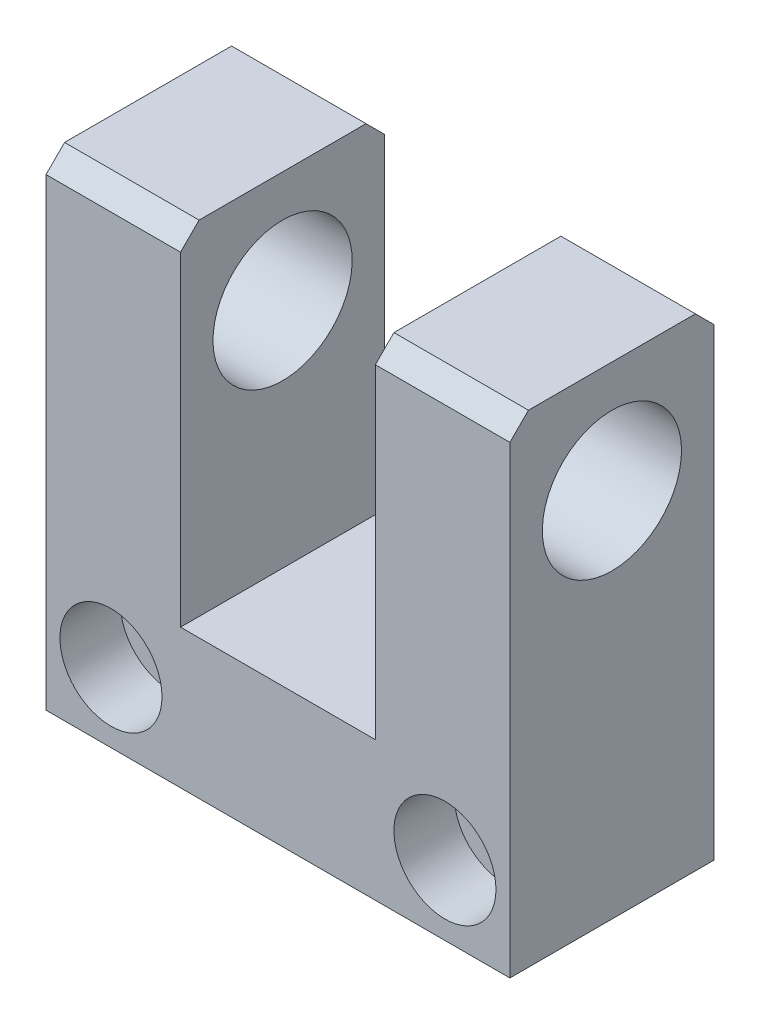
from build123d import *

# Parameters (mm, degrees)
BOSS_EXTRUDE1_DEPTH      = 25
BOSS_EXTRUDE1_DEPTH_BACK = 25
SKETCH1_R                = 7.5
CUT_EXTRUDE1_DEPTH       = 12
CUT_EXTRUDE1_DEPTH_BACK  = 12
SKETCH2_W                = 21
SKETCH2_H                = 37


with BuildPart() as part:
    # Sketch1 → Boss-Extrude1 (new, two sides: drawn at the far end of the back side and taken through both)
    with BuildSketch(Plane(origin=(0, 0, 0), x_dir=(0, 0, -1), z_dir=(1, 0, 0)).offset(-BOSS_EXTRUDE1_DEPTH_BACK)):
        Polygon((-11, 0), (11, 0), (11, 50), (9, 52), (-9, 52), (-11, 50), align=None)
        with Locations((0, 40)):
            Circle(SKETCH1_R, mode=Mode.SUBTRACT)
    extrude(amount=BOSS_EXTRUDE1_DEPTH + BOSS_EXTRUDE1_DEPTH_BACK)

    # Sketch2 → Cut-Extrude1 (cut, two sides: drawn at the far end of the back side and taken through both)
    with BuildSketch(Plane.XY.offset(-CUT_EXTRUDE1_DEPTH_BACK)):
        with Locations((0, 33.5)):
            Rectangle(SKETCH2_W, SKETCH2_H)
    extrude(amount=CUT_EXTRUDE1_DEPTH + CUT_EXTRUDE1_DEPTH_BACK, mode=Mode.SUBTRACT)

    # Sketch3 → Cut-Revolve1 (revolve, cut)
    with BuildSketch(Plane(origin=(18, 0, 0), x_dir=(0, 0, -1), z_dir=(1, 0, 0)), mode=Mode.PRIVATE) as cut_revolve1_sk:
        Polygon((-11, 7.5), (-11, 13), (-4.5, 13), (-4.5, 10.75), (11, 10.75), (11, 7.5), align=None)
    revolve(cut_revolve1_sk.sketch.rotate(Axis((18, 7.5, -11), (0, 0, 1)), 270), axis=Axis((18, 7.5, -11), (0, 0, 1)), mode=Mode.SUBTRACT)

    # Sketch4 → Cut-Revolve2 (revolve, cut)
    with BuildSketch(Plane(origin=(-18, 0, 0), x_dir=(0, 0, -1), z_dir=(1, 0, 0)), mode=Mode.PRIVATE) as cut_revolve2_sk:
        Polygon((-11, 7.5), (-11, 13), (-4.5, 13), (-4.5, 10.75), (11, 10.75), (11, 7.5), align=None)
    revolve(cut_revolve2_sk.sketch.rotate(Axis((-18, 7.5, -11), (0, 0, 1)), 270), axis=Axis((-18, 7.5, -11), (0, 0, 1)), mode=Mode.SUBTRACT)


solid = part.part
